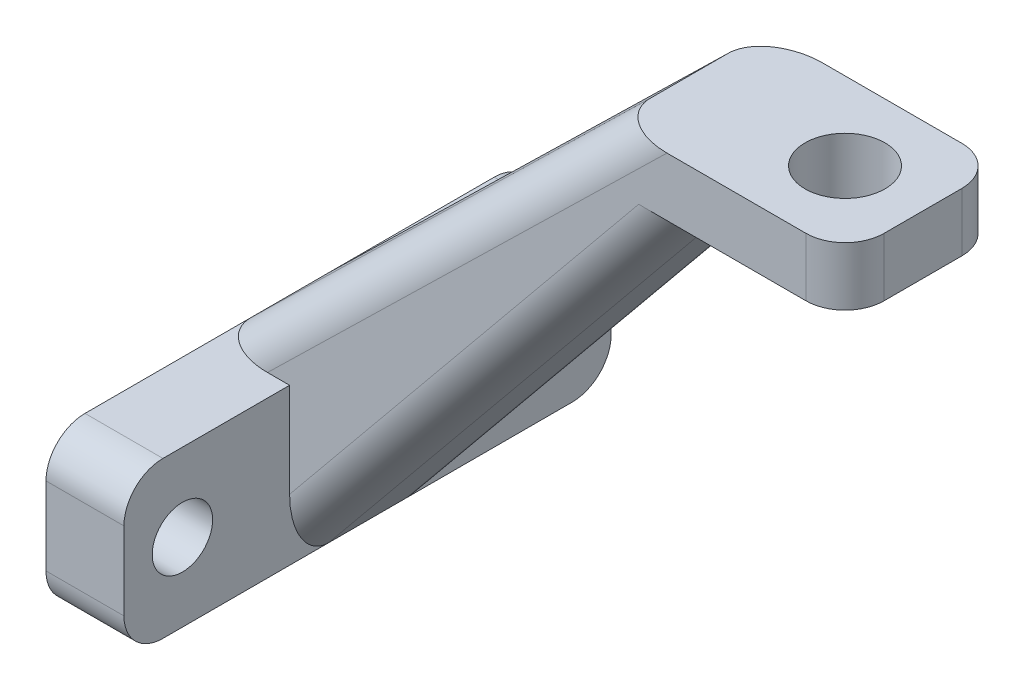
ISO-10303-21;
HEADER;
FILE_DESCRIPTION(('STEP AP214'),'2;1');
FILE_NAME('part.step','',(''),(''),'','','');
FILE_SCHEMA(('AUTOMOTIVE_DESIGN { 1 0 10303 214 1 1 1 1 }'));
ENDSEC;
DATA;
#1=APPLICATION_CONTEXT('core data for automotive mechanical design processes');
#2=APPLICATION_PROTOCOL_DEFINITION('international standard','automotive_design',2000,#1);
#3=PRODUCT_CONTEXT('',#1,'mechanical');
#4=PRODUCT('Part','Part','',(#3));
#5=PRODUCT_RELATED_PRODUCT_CATEGORY('part','',(#4));
#6=PRODUCT_DEFINITION_FORMATION('','',#4);
#7=PRODUCT_DEFINITION_CONTEXT('part definition',#1,'design');
#8=PRODUCT_DEFINITION('design','',#6,#7);
#9=PRODUCT_DEFINITION_SHAPE('','',#8);
#10=(LENGTH_UNIT() NAMED_UNIT(*) SI_UNIT(.MILLI.,.METRE.));
#11=(NAMED_UNIT(*) PLANE_ANGLE_UNIT() SI_UNIT($,.RADIAN.));
#12=(NAMED_UNIT(*) SI_UNIT($,.STERADIAN.) SOLID_ANGLE_UNIT());
#13=UNCERTAINTY_MEASURE_WITH_UNIT(LENGTH_MEASURE(1.E-05),#10,'distance_accuracy_value','');
#14=(GEOMETRIC_REPRESENTATION_CONTEXT(3) GLOBAL_UNCERTAINTY_ASSIGNED_CONTEXT((#13)) GLOBAL_UNIT_ASSIGNED_CONTEXT((#10,
#11,#12)) REPRESENTATION_CONTEXT('',''));
#15=CARTESIAN_POINT('',(0.,0.,0.));
#16=DIRECTION('',(0.,0.,1.));
#17=DIRECTION('',(1.,0.,0.));
#18=AXIS2_PLACEMENT_3D('',#15,#16,#17);
#19=CARTESIAN_POINT('',(-28.5,0.,0.));
#20=DIRECTION('',(1.,0.,0.));
#21=DIRECTION('',(0.,0.,-1.));
#22=AXIS2_PLACEMENT_3D('',#19,#20,#21);
#23=PLANE('',#22);
#24=CARTESIAN_POINT('',(-28.5,-21.,9.5));
#25=DIRECTION('',(1.,0.,0.));
#26=DIRECTION('',(0.,0.,-1.));
#27=AXIS2_PLACEMENT_3D('',#24,#25,#26);
#28=CIRCLE('',#27,1.55);
#29=CARTESIAN_POINT('',(-28.5,-21.,7.95));
#30=VERTEX_POINT('',#29);
#31=EDGE_CURVE('E333',#30,#30,#28,.T.);
#32=ORIENTED_EDGE('',*,*,#31,.T.);
#33=EDGE_LOOP('',(#32));
#34=FACE_BOUND('',#33,.T.);
#35=DIRECTION('',(0.,0.,-1.));
#36=VECTOR('',#35,1.);
#37=CARTESIAN_POINT('',(-28.5,-17.,-12.5));
#38=LINE('',#37,#36);
#39=CARTESIAN_POINT('',(-28.5,-17.,-2.));
#40=VERTEX_POINT('',#39);
#41=CARTESIAN_POINT('',(-28.5,-17.,-10.5));
#42=VERTEX_POINT('',#41);
#43=EDGE_CURVE('E81',#40,#42,#38,.T.);
#44=ORIENTED_EDGE('',*,*,#43,.T.);
#45=CARTESIAN_POINT('',(-28.5,-19.,-10.5));
#46=DIRECTION('',(1.,0.,0.));
#47=DIRECTION('',(0.,0.,-1.));
#48=AXIS2_PLACEMENT_3D('',#45,#46,#47);
#49=CIRCLE('',#48,2.);
#50=CARTESIAN_POINT('',(-28.5,-19.,-12.5));
#51=VERTEX_POINT('',#50);
#52=EDGE_CURVE('E860',#42,#51,#49,.F.);
#53=ORIENTED_EDGE('',*,*,#52,.T.);
#54=DIRECTION('',(0.,-1.,0.));
#55=VECTOR('',#54,1.);
#56=CARTESIAN_POINT('',(-28.5,-25.,-12.5));
#57=LINE('',#56,#55);
#58=CARTESIAN_POINT('',(-28.5,-23.,-12.5));
#59=VERTEX_POINT('',#58);
#60=EDGE_CURVE('E474',#51,#59,#57,.T.);
#61=ORIENTED_EDGE('',*,*,#60,.T.);
#62=CARTESIAN_POINT('',(-28.5,-23.,-10.5));
#63=DIRECTION('',(1.,0.,0.));
#64=DIRECTION('',(0.,0.,-1.));
#65=AXIS2_PLACEMENT_3D('',#62,#63,#64);
#66=CIRCLE('',#65,2.);
#67=CARTESIAN_POINT('',(-28.5,-25.,-10.5));
#68=VERTEX_POINT('',#67);
#69=EDGE_CURVE('E884',#59,#68,#66,.F.);
#70=ORIENTED_EDGE('',*,*,#69,.T.);
#71=DIRECTION('',(0.,0.,1.));
#72=VECTOR('',#71,1.);
#73=CARTESIAN_POINT('',(-28.5,-25.,-12.5));
#74=LINE('',#73,#72);
#75=CARTESIAN_POINT('',(-28.5,-25.,10.5));
#76=VERTEX_POINT('',#75);
#77=EDGE_CURVE('E305',#68,#76,#74,.T.);
#78=ORIENTED_EDGE('',*,*,#77,.T.);
#79=CARTESIAN_POINT('',(-28.5,-23.,10.5));
#80=DIRECTION('',(1.,0.,0.));
#81=DIRECTION('',(0.,0.,-1.));
#82=AXIS2_PLACEMENT_3D('',#79,#80,#81);
#83=CIRCLE('',#82,2.);
#84=CARTESIAN_POINT('',(-28.5,-23.,12.5));
#85=VERTEX_POINT('',#84);
#86=EDGE_CURVE('E484',#76,#85,#83,.F.);
#87=ORIENTED_EDGE('',*,*,#86,.T.);
#88=DIRECTION('',(0.,1.,0.));
#89=VECTOR('',#88,1.);
#90=CARTESIAN_POINT('',(-28.5,-25.,12.5));
#91=LINE('',#90,#89);
#92=CARTESIAN_POINT('',(-28.5,-19.,12.5));
#93=VERTEX_POINT('',#92);
#94=EDGE_CURVE('E297',#85,#93,#91,.T.);
#95=ORIENTED_EDGE('',*,*,#94,.T.);
#96=CARTESIAN_POINT('',(-28.5,-19.,10.5));
#97=DIRECTION('',(1.,0.,0.));
#98=DIRECTION('',(0.,0.,-1.));
#99=AXIS2_PLACEMENT_3D('',#96,#97,#98);
#100=CIRCLE('',#99,2.);
#101=CARTESIAN_POINT('',(-28.5,-17.,10.5));
#102=VERTEX_POINT('',#101);
#103=EDGE_CURVE('E483',#93,#102,#100,.F.);
#104=ORIENTED_EDGE('',*,*,#103,.T.);
#105=CARTESIAN_POINT('',(-28.5,-17.,2.));
#106=VERTEX_POINT('',#105);
#107=EDGE_CURVE('E162',#102,#106,#38,.T.);
#108=ORIENTED_EDGE('',*,*,#107,.T.);
#109=DIRECTION('',(0.,0.,1.));
#110=VECTOR('',#109,1.);
#111=CARTESIAN_POINT('',(-28.5,-17.,-35.6267292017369));
#112=LINE('',#111,#110);
#113=EDGE_CURVE('E319',#40,#106,#112,.T.);
#114=ORIENTED_EDGE('',*,*,#113,.F.);
#115=EDGE_LOOP('',(#44,#53,#61,#70,#78,#87,#95,#104,#108,#114));
#116=FACE_BOUND('',#115,.T.);
#117=CARTESIAN_POINT('',(-28.5,-21.,-9.50000000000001));
#118=DIRECTION('',(1.,0.,0.));
#119=DIRECTION('',(0.,0.,-1.));
#120=AXIS2_PLACEMENT_3D('',#117,#118,#119);
#121=CIRCLE('',#120,1.55);
#122=CARTESIAN_POINT('',(-28.5,-21.,-11.05));
#123=VERTEX_POINT('',#122);
#124=EDGE_CURVE('E341',#123,#123,#121,.F.);
#125=ORIENTED_EDGE('',*,*,#124,.F.);
#126=EDGE_LOOP('',(#125));
#127=FACE_BOUND('',#126,.T.);
#128=ADVANCED_FACE('F47',(#34,#116,#127),#23,.F.);
#129=CARTESIAN_POINT('',(-24.5,-17.,-12.5));
#130=DIRECTION('',(0.,1.,0.));
#131=DIRECTION('',(0.,0.,1.));
#132=AXIS2_PLACEMENT_3D('',#129,#130,#131);
#133=PLANE('',#132);
#134=DIRECTION('',(0.,0.,-1.));
#135=VECTOR('',#134,1.);
#136=CARTESIAN_POINT('',(-24.5,-17.,-12.5));
#137=LINE('',#136,#135);
#138=CARTESIAN_POINT('',(-24.5,-17.,-4.));
#139=VERTEX_POINT('',#138);
#140=CARTESIAN_POINT('',(-24.5,-17.,-10.5));
#141=VERTEX_POINT('',#140);
#142=EDGE_CURVE('E174',#139,#141,#137,.T.);
#143=ORIENTED_EDGE('',*,*,#142,.T.);
#144=DIRECTION('',(-1.,0.,0.));
#145=VECTOR('',#144,1.);
#146=CARTESIAN_POINT('',(-24.5,-17.,-10.5));
#147=LINE('',#146,#145);
#148=EDGE_CURVE('E874',#141,#42,#147,.T.);
#149=ORIENTED_EDGE('',*,*,#148,.T.);
#150=ORIENTED_EDGE('',*,*,#43,.F.);
#151=CARTESIAN_POINT('',(-25.6359993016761,-17.,-2.));
#152=DIRECTION('',(0.,1.,0.));
#153=DIRECTION('',(-1.,0.,0.));
#154=AXIS2_PLACEMENT_3D('',#151,#152,#153);
#155=ELLIPSE('',#154,2.86400069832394,2.);
#156=CARTESIAN_POINT('',(-25.6359993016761,-17.,-4.));
#157=VERTEX_POINT('',#156);
#158=EDGE_CURVE('E165',#40,#157,#155,.F.);
#159=ORIENTED_EDGE('',*,*,#158,.T.);
#160=DIRECTION('',(-1.,0.,0.));
#161=VECTOR('',#160,1.);
#162=CARTESIAN_POINT('',(-28.5,-17.,-4.));
#163=LINE('',#162,#161);
#164=EDGE_CURVE('E328',#139,#157,#163,.T.);
#165=ORIENTED_EDGE('',*,*,#164,.F.);
#166=EDGE_LOOP('',(#143,#149,#150,#159,#165));
#167=FACE_BOUND('',#166,.T.);
#168=ADVANCED_FACE('F241',(#167),#133,.T.);
#169=CARTESIAN_POINT('',(0.,3.,0.));
#170=DIRECTION('',(0.,-1.,0.));
#171=DIRECTION('',(0.,0.,-1.));
#172=AXIS2_PLACEMENT_3D('',#169,#170,#171);
#173=PLANE('',#172);
#174=DIRECTION('',(0.,0.,-1.));
#175=VECTOR('',#174,1.);
#176=CARTESIAN_POINT('',(4.,3.,4.));
#177=LINE('',#176,#175);
#178=CARTESIAN_POINT('',(4.,3.,2.));
#179=VERTEX_POINT('',#178);
#180=CARTESIAN_POINT('',(4.,3.,-2.));
#181=VERTEX_POINT('',#180);
#182=EDGE_CURVE('E386',#179,#181,#177,.T.);
#183=ORIENTED_EDGE('',*,*,#182,.T.);
#184=CARTESIAN_POINT('',(2.,3.,-2.));
#185=DIRECTION('',(0.,-1.,0.));
#186=DIRECTION('',(0.,0.,-1.));
#187=AXIS2_PLACEMENT_3D('',#184,#185,#186);
#188=CIRCLE('',#187,2.);
#189=CARTESIAN_POINT('',(2.,3.,-4.));
#190=VERTEX_POINT('',#189);
#191=EDGE_CURVE('E353',#181,#190,#188,.F.);
#192=ORIENTED_EDGE('',*,*,#191,.T.);
#193=DIRECTION('',(-1.,0.,0.));
#194=VECTOR('',#193,1.);
#195=CARTESIAN_POINT('',(-4.,3.,-4.));
#196=LINE('',#195,#194);
#197=CARTESIAN_POINT('',(-5.13599930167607,3.,-4.));
#198=VERTEX_POINT('',#197);
#199=EDGE_CURVE('E381',#190,#198,#196,.T.);
#200=ORIENTED_EDGE('',*,*,#199,.T.);
#201=CARTESIAN_POINT('',(-5.13599930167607,3.,-2.));
#202=DIRECTION('',(0.,-1.,0.));
#203=DIRECTION('',(-1.,0.,0.));
#204=AXIS2_PLACEMENT_3D('',#201,#202,#203);
#205=ELLIPSE('',#204,2.86400069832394,2.);
#206=CARTESIAN_POINT('',(-8.00000000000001,3.,-2.));
#207=VERTEX_POINT('',#206);
#208=EDGE_CURVE('E834',#198,#207,#205,.F.);
#209=ORIENTED_EDGE('',*,*,#208,.T.);
#210=DIRECTION('',(0.,0.,1.));
#211=VECTOR('',#210,1.);
#212=CARTESIAN_POINT('',(-8.00000000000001,3.,-35.6267292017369));
#213=LINE('',#212,#211);
#214=CARTESIAN_POINT('',(-8.00000000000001,3.,2.));
#215=VERTEX_POINT('',#214);
#216=EDGE_CURVE('E323',#207,#215,#213,.T.);
#217=ORIENTED_EDGE('',*,*,#216,.T.);
#218=CARTESIAN_POINT('',(-5.13599930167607,3.,2.));
#219=DIRECTION('',(0.,-1.,0.));
#220=DIRECTION('',(1.,0.,0.));
#221=AXIS2_PLACEMENT_3D('',#218,#219,#220);
#222=ELLIPSE('',#221,2.86400069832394,2.);
#223=CARTESIAN_POINT('',(-5.13599930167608,3.,4.));
#224=VERTEX_POINT('',#223);
#225=EDGE_CURVE('E830',#215,#224,#222,.F.);
#226=ORIENTED_EDGE('',*,*,#225,.T.);
#227=DIRECTION('',(1.,0.,0.));
#228=VECTOR('',#227,1.);
#229=CARTESIAN_POINT('',(-4.,3.,4.));
#230=LINE('',#229,#228);
#231=CARTESIAN_POINT('',(2.,3.,4.));
#232=VERTEX_POINT('',#231);
#233=EDGE_CURVE('E385',#224,#232,#230,.T.);
#234=ORIENTED_EDGE('',*,*,#233,.T.);
#235=CARTESIAN_POINT('',(2.,3.,2.));
#236=DIRECTION('',(0.,-1.,0.));
#237=DIRECTION('',(0.,0.,-1.));
#238=AXIS2_PLACEMENT_3D('',#235,#236,#237);
#239=CIRCLE('',#238,2.);
#240=EDGE_CURVE('E842',#232,#179,#239,.F.);
#241=ORIENTED_EDGE('',*,*,#240,.T.);
#242=EDGE_LOOP('',(#183,#192,#200,#209,#217,#226,#234,#241));
#243=FACE_BOUND('',#242,.T.);
#244=CARTESIAN_POINT('',(0.,3.,0.));
#245=DIRECTION('',(0.,1.,0.));
#246=DIRECTION('',(0.,0.,1.));
#247=AXIS2_PLACEMENT_3D('',#244,#245,#246);
#248=CIRCLE('',#247,2.05);
#249=CARTESIAN_POINT('',(0.,3.,2.05));
#250=VERTEX_POINT('',#249);
#251=EDGE_CURVE('E457',#250,#250,#248,.T.);
#252=ORIENTED_EDGE('',*,*,#251,.F.);
#253=EDGE_LOOP('',(#252));
#254=FACE_BOUND('',#253,.T.);
#255=ADVANCED_FACE('F427',(#243,#254),#173,.F.);
#256=CARTESIAN_POINT('',(0.,0.,0.));
#257=DIRECTION('',(0.,-1.,0.));
#258=DIRECTION('',(0.,0.,-1.));
#259=AXIS2_PLACEMENT_3D('',#256,#257,#258);
#260=PLANE('',#259);
#261=DIRECTION('',(-1.,0.,0.));
#262=VECTOR('',#261,1.);
#263=CARTESIAN_POINT('',(-4.,0.,-4.));
#264=LINE('',#263,#262);
#265=CARTESIAN_POINT('',(2.,0.,-4.));
#266=VERTEX_POINT('',#265);
#267=CARTESIAN_POINT('',(-6.58642610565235,0.,-4.));
#268=VERTEX_POINT('',#267);
#269=EDGE_CURVE('E364',#266,#268,#264,.T.);
#270=ORIENTED_EDGE('',*,*,#269,.F.);
#271=CARTESIAN_POINT('',(2.,0.,-2.));
#272=DIRECTION('',(0.,-1.,0.));
#273=DIRECTION('',(0.,0.,-1.));
#274=AXIS2_PLACEMENT_3D('',#271,#272,#273);
#275=CIRCLE('',#274,2.);
#276=CARTESIAN_POINT('',(4.,0.,-2.));
#277=VERTEX_POINT('',#276);
#278=EDGE_CURVE('E828',#266,#277,#275,.T.);
#279=ORIENTED_EDGE('',*,*,#278,.T.);
#280=DIRECTION('',(0.,0.,-1.));
#281=VECTOR('',#280,1.);
#282=CARTESIAN_POINT('',(4.,0.,4.));
#283=LINE('',#282,#281);
#284=CARTESIAN_POINT('',(4.,0.,2.));
#285=VERTEX_POINT('',#284);
#286=EDGE_CURVE('E370',#285,#277,#283,.T.);
#287=ORIENTED_EDGE('',*,*,#286,.F.);
#288=CARTESIAN_POINT('',(2.,0.,2.));
#289=DIRECTION('',(0.,-1.,0.));
#290=DIRECTION('',(0.,0.,-1.));
#291=AXIS2_PLACEMENT_3D('',#288,#289,#290);
#292=CIRCLE('',#291,2.);
#293=CARTESIAN_POINT('',(2.,0.,4.));
#294=VERTEX_POINT('',#293);
#295=EDGE_CURVE('E399',#285,#294,#292,.T.);
#296=ORIENTED_EDGE('',*,*,#295,.T.);
#297=DIRECTION('',(1.,0.,0.));
#298=VECTOR('',#297,1.);
#299=CARTESIAN_POINT('',(-4.,0.,4.));
#300=LINE('',#299,#298);
#301=CARTESIAN_POINT('',(-6.58642610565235,0.,4.));
#302=VERTEX_POINT('',#301);
#303=EDGE_CURVE('E93',#302,#294,#300,.T.);
#304=ORIENTED_EDGE('',*,*,#303,.F.);
#305=CARTESIAN_POINT('',(-6.58642610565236,0.,2.));
#306=DIRECTION('',(0.,-1.,0.));
#307=DIRECTION('',(-1.,0.,0.));
#308=AXIS2_PLACEMENT_3D('',#305,#306,#307);
#309=ELLIPSE('',#308,2.58642610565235,2.);
#310=CARTESIAN_POINT('',(-4.,0.,2.));
#311=VERTEX_POINT('',#310);
#312=EDGE_CURVE('E193',#302,#311,#309,.F.);
#313=ORIENTED_EDGE('',*,*,#312,.T.);
#314=CARTESIAN_POINT('',(-4.,0.,-2.));
#315=DIRECTION('',(0.,0.,1.));
#316=VECTOR('',#315,1.);
#317=LINE('',#314,#316);
#318=CARTESIAN_POINT('',(-4.,0.,-2.));
#319=VERTEX_POINT('',#318);
#320=EDGE_CURVE('E369',#319,#311,#317,.T.);
#321=ORIENTED_EDGE('',*,*,#320,.F.);
#322=CARTESIAN_POINT('',(-6.58642610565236,0.,-2.));
#323=DIRECTION('',(0.,-1.,0.));
#324=DIRECTION('',(-1.,0.,0.));
#325=AXIS2_PLACEMENT_3D('',#322,#323,#324);
#326=ELLIPSE('',#325,2.58642610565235,2.);
#327=EDGE_CURVE('E59',#319,#268,#326,.F.);
#328=ORIENTED_EDGE('',*,*,#327,.T.);
#329=EDGE_LOOP('',(#270,#279,#287,#296,#304,#313,#321,#328));
#330=FACE_BOUND('',#329,.T.);
#331=CARTESIAN_POINT('',(0.,0.,0.));
#332=DIRECTION('',(0.,1.,0.));
#333=DIRECTION('',(0.,0.,1.));
#334=AXIS2_PLACEMENT_3D('',#331,#332,#333);
#335=CIRCLE('',#334,2.05);
#336=CARTESIAN_POINT('',(0.,0.,2.05));
#337=VERTEX_POINT('',#336);
#338=EDGE_CURVE('E460',#337,#337,#335,.T.);
#339=ORIENTED_EDGE('',*,*,#338,.T.);
#340=EDGE_LOOP('',(#339));
#341=FACE_BOUND('',#340,.T.);
#342=ADVANCED_FACE('F430',(#330,#341),#260,.T.);
#343=CARTESIAN_POINT('',(4.,3.,4.));
#344=DIRECTION('',(-1.,0.,0.));
#345=DIRECTION('',(0.,0.,1.));
#346=AXIS2_PLACEMENT_3D('',#343,#344,#345);
#347=PLANE('',#346);
#348=ORIENTED_EDGE('',*,*,#286,.T.);
#349=DIRECTION('',(0.,-1.,0.));
#350=VECTOR('',#349,1.);
#351=CARTESIAN_POINT('',(4.,3.,-2.));
#352=LINE('',#351,#350);
#353=EDGE_CURVE('E823',#277,#181,#352,.F.);
#354=ORIENTED_EDGE('',*,*,#353,.T.);
#355=ORIENTED_EDGE('',*,*,#182,.F.);
#356=DIRECTION('',(0.,-1.,0.));
#357=VECTOR('',#356,1.);
#358=CARTESIAN_POINT('',(4.,3.,2.));
#359=LINE('',#358,#357);
#360=EDGE_CURVE('E825',#179,#285,#359,.T.);
#361=ORIENTED_EDGE('',*,*,#360,.T.);
#362=EDGE_LOOP('',(#348,#354,#355,#361));
#363=FACE_BOUND('',#362,.T.);
#364=ADVANCED_FACE('F435',(#363),#347,.F.);
#365=CARTESIAN_POINT('',(-4.,3.,-4.));
#366=DIRECTION('',(0.,0.,1.));
#367=DIRECTION('',(1.,0.,0.));
#368=AXIS2_PLACEMENT_3D('',#365,#366,#367);
#369=PLANE('',#368);
#370=ORIENTED_EDGE('',*,*,#199,.F.);
#371=DIRECTION('',(0.,-1.,0.));
#372=VECTOR('',#371,1.);
#373=CARTESIAN_POINT('',(2.,3.,-4.));
#374=LINE('',#373,#372);
#375=EDGE_CURVE('E395',#190,#266,#374,.T.);
#376=ORIENTED_EDGE('',*,*,#375,.T.);
#377=ORIENTED_EDGE('',*,*,#269,.T.);
#378=DIRECTION('',(0.634079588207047,0.773267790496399,0.));
#379=VECTOR('',#378,1.);
#380=CARTESIAN_POINT('',(-26.0465355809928,-23.7318408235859,-4.));
#381=LINE('',#380,#379);
#382=CARTESIAN_POINT('',(-24.5,-21.8458218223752,-4.));
#383=VERTEX_POINT('',#382);
#384=EDGE_CURVE('E387',#268,#383,#381,.F.);
#385=ORIENTED_EDGE('',*,*,#384,.T.);
#386=DIRECTION('',(0.,1.,0.));
#387=VECTOR('',#386,1.);
#388=CARTESIAN_POINT('',(-24.5,-25.,-4.));
#389=LINE('',#388,#387);
#390=EDGE_CURVE('E371',#383,#139,#389,.T.);
#391=ORIENTED_EDGE('',*,*,#390,.T.);
#392=ORIENTED_EDGE('',*,*,#164,.T.);
#393=DIRECTION('',(0.715781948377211,0.698323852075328,0.));
#394=VECTOR('',#393,1.);
#395=CARTESIAN_POINT('',(-6.60335229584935,1.56843610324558,-4.));
#396=LINE('',#395,#394);
#397=EDGE_CURVE('E391',#157,#198,#396,.T.);
#398=ORIENTED_EDGE('',*,*,#397,.T.);
#399=EDGE_LOOP('',(#370,#376,#377,#385,#391,#392,#398));
#400=FACE_BOUND('',#399,.T.);
#401=ADVANCED_FACE('F573',(#400),#369,.F.);
#402=CARTESIAN_POINT('',(-4.,3.,4.));
#403=DIRECTION('',(0.,0.,-1.));
#404=DIRECTION('',(-1.,0.,0.));
#405=AXIS2_PLACEMENT_3D('',#402,#403,#404);
#406=PLANE('',#405);
#407=ORIENTED_EDGE('',*,*,#303,.T.);
#408=DIRECTION('',(0.,-1.,0.));
#409=VECTOR('',#408,1.);
#410=CARTESIAN_POINT('',(2.,3.,4.));
#411=LINE('',#410,#409);
#412=EDGE_CURVE('E552',#294,#232,#411,.F.);
#413=ORIENTED_EDGE('',*,*,#412,.T.);
#414=ORIENTED_EDGE('',*,*,#233,.F.);
#415=DIRECTION('',(-0.715781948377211,-0.698323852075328,0.));
#416=VECTOR('',#415,1.);
#417=CARTESIAN_POINT('',(-27.1033522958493,-18.4315638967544,4.));
#418=LINE('',#417,#416);
#419=CARTESIAN_POINT('',(-25.6359993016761,-17.,4.));
#420=VERTEX_POINT('',#419);
#421=EDGE_CURVE('E547',#224,#420,#418,.T.);
#422=ORIENTED_EDGE('',*,*,#421,.T.);
#423=DIRECTION('',(1.,0.,0.));
#424=VECTOR('',#423,1.);
#425=CARTESIAN_POINT('',(-28.5,-17.,4.));
#426=LINE('',#425,#424);
#427=CARTESIAN_POINT('',(-24.5,-17.,4.));
#428=VERTEX_POINT('',#427);
#429=EDGE_CURVE('E324',#420,#428,#426,.T.);
#430=ORIENTED_EDGE('',*,*,#429,.T.);
#431=DIRECTION('',(0.,1.,0.));
#432=VECTOR('',#431,1.);
#433=CARTESIAN_POINT('',(-24.5,-25.,4.));
#434=LINE('',#433,#432);
#435=CARTESIAN_POINT('',(-24.5,-21.8458218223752,4.));
#436=VERTEX_POINT('',#435);
#437=EDGE_CURVE('E170',#436,#428,#434,.T.);
#438=ORIENTED_EDGE('',*,*,#437,.F.);
#439=DIRECTION('',(0.634079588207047,0.773267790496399,0.));
#440=VECTOR('',#439,1.);
#441=CARTESIAN_POINT('',(-5.5465355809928,1.26815917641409,4.));
#442=LINE('',#441,#440);
#443=EDGE_CURVE('E553',#436,#302,#442,.T.);
#444=ORIENTED_EDGE('',*,*,#443,.T.);
#445=EDGE_LOOP('',(#407,#413,#414,#422,#430,#438,#444));
#446=FACE_BOUND('',#445,.T.);
#447=ADVANCED_FACE('F425',(#446),#406,.F.);
#448=CARTESIAN_POINT('',(0.,3.,0.));
#449=DIRECTION('',(0.,-1.,0.));
#450=DIRECTION('',(0.,0.,-1.));
#451=AXIS2_PLACEMENT_3D('',#448,#449,#450);
#452=CYLINDRICAL_SURFACE('',#451,2.05);
#453=ORIENTED_EDGE('',*,*,#251,.T.);
#454=EDGE_LOOP('',(#453));
#455=FACE_BOUND('',#454,.T.);
#456=ORIENTED_EDGE('',*,*,#338,.F.);
#457=EDGE_LOOP('',(#456));
#458=FACE_BOUND('',#457,.T.);
#459=ADVANCED_FACE('F421',(#455,#458),#452,.F.);
#460=CARTESIAN_POINT('',(-2.39177230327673,1.96125328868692,0.));
#461=DIRECTION('',(0.773267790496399,-0.634079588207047,0.));
#462=DIRECTION('',(0.634079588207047,0.773267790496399,0.));
#463=AXIS2_PLACEMENT_3D('',#460,#461,#462);
#464=PLANE('',#463);
#465=ORIENTED_EDGE('',*,*,#320,.T.);
#466=DIRECTION('',(0.634079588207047,0.773267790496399,0.));
#467=VECTOR('',#466,1.);
#468=CARTESIAN_POINT('',(-24.5,-25.,2.));
#469=LINE('',#468,#467);
#470=CARTESIAN_POINT('',(-24.5,-25.,2.));
#471=VERTEX_POINT('',#470);
#472=EDGE_CURVE('E279',#311,#471,#469,.F.);
#473=ORIENTED_EDGE('',*,*,#472,.T.);
#474=DIRECTION('',(0.,0.,-1.));
#475=VECTOR('',#474,1.);
#476=CARTESIAN_POINT('',(-24.5,-25.,4.));
#477=LINE('',#476,#475);
#478=CARTESIAN_POINT('',(-24.5,-25.,-2.));
#479=VERTEX_POINT('',#478);
#480=EDGE_CURVE('E51',#471,#479,#477,.T.);
#481=ORIENTED_EDGE('',*,*,#480,.T.);
#482=DIRECTION('',(0.634079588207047,0.773267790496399,0.));
#483=VECTOR('',#482,1.);
#484=CARTESIAN_POINT('',(-4.00000000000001,0.,-2.));
#485=LINE('',#484,#483);
#486=EDGE_CURVE('E275',#479,#319,#485,.T.);
#487=ORIENTED_EDGE('',*,*,#486,.T.);
#488=EDGE_LOOP('',(#465,#473,#481,#487));
#489=FACE_BOUND('',#488,.T.);
#490=ADVANCED_FACE('F411',(#489),#464,.T.);
#491=CARTESIAN_POINT('',(-24.5,0.,0.));
#492=DIRECTION('',(1.,0.,0.));
#493=DIRECTION('',(0.,0.,-1.));
#494=AXIS2_PLACEMENT_3D('',#491,#492,#493);
#495=PLANE('',#494);
#496=CARTESIAN_POINT('',(-24.5,-21.,9.5));
#497=DIRECTION('',(1.,0.,0.));
#498=DIRECTION('',(0.,0.,-1.));
#499=AXIS2_PLACEMENT_3D('',#496,#497,#498);
#500=CIRCLE('',#499,1.55);
#501=CARTESIAN_POINT('',(-24.5,-21.,7.95));
#502=VERTEX_POINT('',#501);
#503=EDGE_CURVE('E329',#502,#502,#500,.T.);
#504=ORIENTED_EDGE('',*,*,#503,.F.);
#505=EDGE_LOOP('',(#504));
#506=FACE_BOUND('',#505,.T.);
#507=DIRECTION('',(0.,1.,0.));
#508=VECTOR('',#507,1.);
#509=CARTESIAN_POINT('',(-24.5,-25.,12.5));
#510=LINE('',#509,#508);
#511=CARTESIAN_POINT('',(-24.5,-23.,12.5));
#512=VERTEX_POINT('',#511);
#513=CARTESIAN_POINT('',(-24.5,-19.,12.5));
#514=VERTEX_POINT('',#513);
#515=EDGE_CURVE('E309',#512,#514,#510,.T.);
#516=ORIENTED_EDGE('',*,*,#515,.F.);
#517=CARTESIAN_POINT('',(-24.5,-23.,10.5));
#518=DIRECTION('',(1.,0.,0.));
#519=DIRECTION('',(0.,0.,-1.));
#520=AXIS2_PLACEMENT_3D('',#517,#518,#519);
#521=CIRCLE('',#520,2.);
#522=CARTESIAN_POINT('',(-24.5,-25.,10.5));
#523=VERTEX_POINT('',#522);
#524=EDGE_CURVE('E166',#512,#523,#521,.T.);
#525=ORIENTED_EDGE('',*,*,#524,.T.);
#526=DIRECTION('',(0.,0.,1.));
#527=VECTOR('',#526,1.);
#528=CARTESIAN_POINT('',(-24.5,-25.,-12.5));
#529=LINE('',#528,#527);
#530=CARTESIAN_POINT('',(-24.5,-25.,4.));
#531=VERTEX_POINT('',#530);
#532=EDGE_CURVE('E292',#531,#523,#529,.T.);
#533=ORIENTED_EDGE('',*,*,#532,.F.);
#534=CARTESIAN_POINT('',(-24.5,-25.,4.));
#535=DIRECTION('',(0.,0.,-1.));
#536=VECTOR('',#535,1.);
#537=LINE('',#534,#536);
#538=EDGE_CURVE('E213',#531,#471,#537,.T.);
#539=ORIENTED_EDGE('',*,*,#538,.T.);
#540=CARTESIAN_POINT('',(-24.5,-21.8458218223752,2.));
#541=DIRECTION('',(1.,0.,0.));
#542=DIRECTION('',(0.,-1.,0.));
#543=AXIS2_PLACEMENT_3D('',#540,#541,#542);
#544=ELLIPSE('',#543,3.15417817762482,2.);
#545=EDGE_CURVE('E196',#471,#436,#544,.F.);
#546=ORIENTED_EDGE('',*,*,#545,.T.);
#547=ORIENTED_EDGE('',*,*,#437,.T.);
#548=CARTESIAN_POINT('',(-24.5,-17.,10.5));
#549=VERTEX_POINT('',#548);
#550=EDGE_CURVE('E159',#549,#428,#137,.T.);
#551=ORIENTED_EDGE('',*,*,#550,.F.);
#552=CARTESIAN_POINT('',(-24.5,-19.,10.5));
#553=DIRECTION('',(1.,0.,0.));
#554=DIRECTION('',(0.,0.,-1.));
#555=AXIS2_PLACEMENT_3D('',#552,#553,#554);
#556=CIRCLE('',#555,2.);
#557=EDGE_CURVE('E148',#549,#514,#556,.T.);
#558=ORIENTED_EDGE('',*,*,#557,.T.);
#559=EDGE_LOOP('',(#516,#525,#533,#539,#546,#547,#551,#558));
#560=FACE_BOUND('',#559,.T.);
#561=ADVANCED_FACE('F168',(#506,#560),#495,.T.);
#562=CARTESIAN_POINT('',(-24.5,-25.,12.5));
#563=DIRECTION('',(0.,0.,1.));
#564=DIRECTION('',(1.,0.,0.));
#565=AXIS2_PLACEMENT_3D('',#562,#563,#564);
#566=PLANE('',#565);
#567=ORIENTED_EDGE('',*,*,#94,.F.);
#568=DIRECTION('',(-1.,0.,0.));
#569=VECTOR('',#568,1.);
#570=CARTESIAN_POINT('',(-24.5,-23.,12.5));
#571=LINE('',#570,#569);
#572=EDGE_CURVE('E180',#85,#512,#571,.F.);
#573=ORIENTED_EDGE('',*,*,#572,.T.);
#574=ORIENTED_EDGE('',*,*,#515,.T.);
#575=DIRECTION('',(-1.,0.,0.));
#576=VECTOR('',#575,1.);
#577=CARTESIAN_POINT('',(-24.5,-19.,12.5));
#578=LINE('',#577,#576);
#579=EDGE_CURVE('E178',#514,#93,#578,.T.);
#580=ORIENTED_EDGE('',*,*,#579,.T.);
#581=EDGE_LOOP('',(#567,#573,#574,#580));
#582=FACE_BOUND('',#581,.T.);
#583=ADVANCED_FACE('F248',(#582),#566,.T.);
#584=CARTESIAN_POINT('',(-24.5,-25.,-12.5));
#585=DIRECTION('',(0.,-1.,0.));
#586=DIRECTION('',(0.,0.,-1.));
#587=AXIS2_PLACEMENT_3D('',#584,#585,#586);
#588=PLANE('',#587);
#589=ORIENTED_EDGE('',*,*,#77,.F.);
#590=DIRECTION('',(-1.,0.,0.));
#591=VECTOR('',#590,1.);
#592=CARTESIAN_POINT('',(-24.5,-25.,-10.5));
#593=LINE('',#592,#591);
#594=CARTESIAN_POINT('',(-24.5,-25.,-10.5));
#595=VERTEX_POINT('',#594);
#596=EDGE_CURVE('E876',#68,#595,#593,.F.);
#597=ORIENTED_EDGE('',*,*,#596,.T.);
#598=CARTESIAN_POINT('',(-24.5,-25.,-4.));
#599=VERTEX_POINT('',#598);
#600=EDGE_CURVE('E288',#595,#599,#529,.T.);
#601=ORIENTED_EDGE('',*,*,#600,.T.);
#602=CARTESIAN_POINT('',(-24.5,-25.,-2.));
#603=DIRECTION('',(0.,0.,-1.));
#604=VECTOR('',#603,1.);
#605=LINE('',#602,#604);
#606=EDGE_CURVE('E66',#479,#599,#605,.T.);
#607=ORIENTED_EDGE('',*,*,#606,.F.);
#608=ORIENTED_EDGE('',*,*,#480,.F.);
#609=ORIENTED_EDGE('',*,*,#538,.F.);
#610=ORIENTED_EDGE('',*,*,#532,.T.);
#611=DIRECTION('',(-1.,0.,0.));
#612=VECTOR('',#611,1.);
#613=CARTESIAN_POINT('',(-24.5,-25.,10.5));
#614=LINE('',#613,#612);
#615=EDGE_CURVE('E285',#523,#76,#614,.T.);
#616=ORIENTED_EDGE('',*,*,#615,.T.);
#617=EDGE_LOOP('',(#589,#597,#601,#607,#608,#609,#610,#616));
#618=FACE_BOUND('',#617,.T.);
#619=ADVANCED_FACE('F243',(#618),#588,.T.);
#620=CARTESIAN_POINT('',(-24.5,-25.,-12.5));
#621=DIRECTION('',(0.,0.,-1.));
#622=DIRECTION('',(-1.,0.,0.));
#623=AXIS2_PLACEMENT_3D('',#620,#621,#622);
#624=PLANE('',#623);
#625=ORIENTED_EDGE('',*,*,#60,.F.);
#626=DIRECTION('',(-1.,0.,0.));
#627=VECTOR('',#626,1.);
#628=CARTESIAN_POINT('',(-24.5,-19.,-12.5));
#629=LINE('',#628,#627);
#630=CARTESIAN_POINT('',(-24.5,-19.,-12.5));
#631=VERTEX_POINT('',#630);
#632=EDGE_CURVE('E855',#51,#631,#629,.F.);
#633=ORIENTED_EDGE('',*,*,#632,.T.);
#634=DIRECTION('',(0.,-1.,0.));
#635=VECTOR('',#634,1.);
#636=CARTESIAN_POINT('',(-24.5,-25.,-12.5));
#637=LINE('',#636,#635);
#638=CARTESIAN_POINT('',(-24.5,-23.,-12.5));
#639=VERTEX_POINT('',#638);
#640=EDGE_CURVE('E173',#631,#639,#637,.T.);
#641=ORIENTED_EDGE('',*,*,#640,.T.);
#642=DIRECTION('',(-1.,0.,0.));
#643=VECTOR('',#642,1.);
#644=CARTESIAN_POINT('',(-24.5,-23.,-12.5));
#645=LINE('',#644,#643);
#646=EDGE_CURVE('E857',#639,#59,#645,.T.);
#647=ORIENTED_EDGE('',*,*,#646,.T.);
#648=EDGE_LOOP('',(#625,#633,#641,#647));
#649=FACE_BOUND('',#648,.T.);
#650=ADVANCED_FACE('F247',(#649),#624,.T.);
#651=ORIENTED_EDGE('',*,*,#107,.F.);
#652=DIRECTION('',(-1.,0.,0.));
#653=VECTOR('',#652,1.);
#654=CARTESIAN_POINT('',(-24.5,-17.,10.5));
#655=LINE('',#654,#653);
#656=EDGE_CURVE('E155',#102,#549,#655,.F.);
#657=ORIENTED_EDGE('',*,*,#656,.T.);
#658=ORIENTED_EDGE('',*,*,#550,.T.);
#659=ORIENTED_EDGE('',*,*,#429,.F.);
#660=CARTESIAN_POINT('',(-25.6359993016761,-17.,2.));
#661=DIRECTION('',(0.,1.,0.));
#662=DIRECTION('',(1.,0.,0.));
#663=AXIS2_PLACEMENT_3D('',#660,#661,#662);
#664=ELLIPSE('',#663,2.86400069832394,2.);
#665=EDGE_CURVE('E190',#420,#106,#664,.F.);
#666=ORIENTED_EDGE('',*,*,#665,.T.);
#667=EDGE_LOOP('',(#651,#657,#658,#659,#666));
#668=FACE_BOUND('',#667,.T.);
#669=ADVANCED_FACE('F156',(#668),#133,.T.);
#670=CARTESIAN_POINT('',(-24.5,-21.,-9.50000000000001));
#671=DIRECTION('',(1.,0.,0.));
#672=DIRECTION('',(0.,0.,-1.));
#673=AXIS2_PLACEMENT_3D('',#670,#671,#672);
#674=CIRCLE('',#673,1.55);
#675=CARTESIAN_POINT('',(-24.5,-21.,-11.05));
#676=VERTEX_POINT('',#675);
#677=EDGE_CURVE('E337',#676,#676,#674,.F.);
#678=ORIENTED_EDGE('',*,*,#677,.T.);
#679=EDGE_LOOP('',(#678));
#680=FACE_BOUND('',#679,.T.);
#681=ORIENTED_EDGE('',*,*,#640,.F.);
#682=CARTESIAN_POINT('',(-24.5,-19.,-10.5));
#683=DIRECTION('',(1.,0.,0.));
#684=DIRECTION('',(0.,0.,-1.));
#685=AXIS2_PLACEMENT_3D('',#682,#683,#684);
#686=CIRCLE('',#685,2.);
#687=EDGE_CURVE('E861',#631,#141,#686,.T.);
#688=ORIENTED_EDGE('',*,*,#687,.T.);
#689=ORIENTED_EDGE('',*,*,#142,.F.);
#690=ORIENTED_EDGE('',*,*,#390,.F.);
#691=CARTESIAN_POINT('',(-24.5,-21.8458218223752,-2.));
#692=DIRECTION('',(1.,0.,0.));
#693=DIRECTION('',(0.,-1.,0.));
#694=AXIS2_PLACEMENT_3D('',#691,#692,#693);
#695=ELLIPSE('',#694,3.15417817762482,2.);
#696=EDGE_CURVE('E12',#383,#479,#695,.F.);
#697=ORIENTED_EDGE('',*,*,#696,.T.);
#698=ORIENTED_EDGE('',*,*,#606,.T.);
#699=ORIENTED_EDGE('',*,*,#600,.F.);
#700=CARTESIAN_POINT('',(-24.5,-23.,-10.5));
#701=DIRECTION('',(1.,0.,0.));
#702=DIRECTION('',(0.,0.,-1.));
#703=AXIS2_PLACEMENT_3D('',#700,#701,#702);
#704=CIRCLE('',#703,2.);
#705=EDGE_CURVE('E863',#595,#639,#704,.T.);
#706=ORIENTED_EDGE('',*,*,#705,.T.);
#707=EDGE_LOOP('',(#681,#688,#689,#690,#697,#698,#699,#706));
#708=FACE_BOUND('',#707,.T.);
#709=ADVANCED_FACE('F218',(#680,#708),#495,.T.);
#710=CARTESIAN_POINT('',(-8.00000000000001,3.,-35.6267292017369));
#711=DIRECTION('',(-0.698323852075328,0.715781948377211,0.));
#712=DIRECTION('',(-0.715781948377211,-0.698323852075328,0.));
#713=AXIS2_PLACEMENT_3D('',#710,#711,#712);
#714=PLANE('',#713);
#715=ORIENTED_EDGE('',*,*,#216,.F.);
#716=DIRECTION('',(0.715781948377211,0.698323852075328,0.));
#717=VECTOR('',#716,1.);
#718=CARTESIAN_POINT('',(-28.5,-17.,-2.));
#719=LINE('',#718,#717);
#720=EDGE_CURVE('E280',#207,#40,#719,.F.);
#721=ORIENTED_EDGE('',*,*,#720,.T.);
#722=ORIENTED_EDGE('',*,*,#113,.T.);
#723=DIRECTION('',(-0.715781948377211,-0.698323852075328,0.));
#724=VECTOR('',#723,1.);
#725=CARTESIAN_POINT('',(-8.00000000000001,3.,2.));
#726=LINE('',#725,#724);
#727=EDGE_CURVE('E548',#106,#215,#726,.F.);
#728=ORIENTED_EDGE('',*,*,#727,.T.);
#729=EDGE_LOOP('',(#715,#721,#722,#728));
#730=FACE_BOUND('',#729,.T.);
#731=ADVANCED_FACE('F228',(#730),#714,.T.);
#732=CARTESIAN_POINT('',(-28.5,-21.,9.5));
#733=DIRECTION('',(1.,0.,0.));
#734=DIRECTION('',(0.,0.,-1.));
#735=AXIS2_PLACEMENT_3D('',#732,#733,#734);
#736=CYLINDRICAL_SURFACE('',#735,1.55);
#737=ORIENTED_EDGE('',*,*,#31,.F.);
#738=EDGE_LOOP('',(#737));
#739=FACE_BOUND('',#738,.T.);
#740=ORIENTED_EDGE('',*,*,#503,.T.);
#741=EDGE_LOOP('',(#740));
#742=FACE_BOUND('',#741,.T.);
#743=ADVANCED_FACE('F680',(#739,#742),#736,.F.);
#744=CARTESIAN_POINT('',(-28.5,-21.,-9.50000000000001));
#745=DIRECTION('',(1.,0.,0.));
#746=DIRECTION('',(0.,0.,-1.));
#747=AXIS2_PLACEMENT_3D('',#744,#745,#746);
#748=CYLINDRICAL_SURFACE('',#747,1.55);
#749=ORIENTED_EDGE('',*,*,#124,.T.);
#750=EDGE_LOOP('',(#749));
#751=FACE_BOUND('',#750,.T.);
#752=ORIENTED_EDGE('',*,*,#677,.F.);
#753=EDGE_LOOP('',(#752));
#754=FACE_BOUND('',#753,.T.);
#755=ADVANCED_FACE('F668',(#751,#754),#748,.F.);
#756=CARTESIAN_POINT('',(2.,3.,-2.));
#757=DIRECTION('',(0.,-1.,0.));
#758=DIRECTION('',(0.,0.,-1.));
#759=AXIS2_PLACEMENT_3D('',#756,#757,#758);
#760=CYLINDRICAL_SURFACE('',#759,2.);
#761=ORIENTED_EDGE('',*,*,#191,.F.);
#762=ORIENTED_EDGE('',*,*,#353,.F.);
#763=ORIENTED_EDGE('',*,*,#278,.F.);
#764=ORIENTED_EDGE('',*,*,#375,.F.);
#765=EDGE_LOOP('',(#761,#762,#763,#764));
#766=FACE_BOUND('',#765,.T.);
#767=ADVANCED_FACE('F658',(#766),#760,.T.);
#768=CARTESIAN_POINT('',(2.,3.,2.));
#769=DIRECTION('',(0.,-1.,0.));
#770=DIRECTION('',(0.,0.,-1.));
#771=AXIS2_PLACEMENT_3D('',#768,#769,#770);
#772=CYLINDRICAL_SURFACE('',#771,2.);
#773=ORIENTED_EDGE('',*,*,#240,.F.);
#774=ORIENTED_EDGE('',*,*,#412,.F.);
#775=ORIENTED_EDGE('',*,*,#295,.F.);
#776=ORIENTED_EDGE('',*,*,#360,.F.);
#777=EDGE_LOOP('',(#773,#774,#775,#776));
#778=FACE_BOUND('',#777,.T.);
#779=ADVANCED_FACE('F650',(#778),#772,.T.);
#780=CARTESIAN_POINT('',(-4.55397710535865,3.56782653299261,-2.));
#781=DIRECTION('',(-0.715781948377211,-0.698323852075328,0.));
#782=DIRECTION('',(0.698323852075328,-0.715781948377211,0.));
#783=AXIS2_PLACEMENT_3D('',#780,#781,#782);
#784=CYLINDRICAL_SURFACE('',#783,2.);
#785=ORIENTED_EDGE('',*,*,#158,.F.);
#786=ORIENTED_EDGE('',*,*,#720,.F.);
#787=ORIENTED_EDGE('',*,*,#208,.F.);
#788=ORIENTED_EDGE('',*,*,#397,.F.);
#789=EDGE_LOOP('',(#785,#786,#787,#788));
#790=FACE_BOUND('',#789,.T.);
#791=ADVANCED_FACE('F568',(#790),#784,.T.);
#792=CARTESIAN_POINT('',(-4.55397710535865,3.56782653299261,2.));
#793=DIRECTION('',(0.715781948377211,0.698323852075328,0.));
#794=DIRECTION('',(-0.698323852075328,0.715781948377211,0.));
#795=AXIS2_PLACEMENT_3D('',#792,#793,#794);
#796=CYLINDRICAL_SURFACE('',#795,2.);
#797=ORIENTED_EDGE('',*,*,#225,.F.);
#798=ORIENTED_EDGE('',*,*,#727,.F.);
#799=ORIENTED_EDGE('',*,*,#665,.F.);
#800=ORIENTED_EDGE('',*,*,#421,.F.);
#801=EDGE_LOOP('',(#797,#798,#799,#800));
#802=FACE_BOUND('',#801,.T.);
#803=ADVANCED_FACE('F546',(#802),#796,.T.);
#804=CARTESIAN_POINT('',(-4.07559561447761,3.06198840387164,2.));
#805=DIRECTION('',(-0.634079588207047,-0.773267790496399,0.));
#806=DIRECTION('',(0.773267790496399,-0.634079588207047,0.));
#807=AXIS2_PLACEMENT_3D('',#804,#805,#806);
#808=CYLINDRICAL_SURFACE('',#807,2.);
#809=ORIENTED_EDGE('',*,*,#545,.F.);
#810=ORIENTED_EDGE('',*,*,#472,.F.);
#811=ORIENTED_EDGE('',*,*,#312,.F.);
#812=ORIENTED_EDGE('',*,*,#443,.F.);
#813=EDGE_LOOP('',(#809,#810,#811,#812));
#814=FACE_BOUND('',#813,.T.);
#815=ADVANCED_FACE('F585',(#814),#808,.T.);
#816=CARTESIAN_POINT('',(-3.93830788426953,3.22941246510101,-2.));
#817=DIRECTION('',(-0.634079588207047,-0.773267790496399,0.));
#818=DIRECTION('',(0.773267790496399,-0.634079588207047,0.));
#819=AXIS2_PLACEMENT_3D('',#816,#817,#818);
#820=CYLINDRICAL_SURFACE('',#819,2.);
#821=ORIENTED_EDGE('',*,*,#696,.F.);
#822=ORIENTED_EDGE('',*,*,#384,.F.);
#823=ORIENTED_EDGE('',*,*,#327,.F.);
#824=ORIENTED_EDGE('',*,*,#486,.F.);
#825=EDGE_LOOP('',(#821,#822,#823,#824));
#826=FACE_BOUND('',#825,.T.);
#827=ADVANCED_FACE('F580',(#826),#820,.T.);
#828=CARTESIAN_POINT('',(-24.5,-19.,-10.5));
#829=DIRECTION('',(-1.,0.,0.));
#830=DIRECTION('',(0.,0.,1.));
#831=AXIS2_PLACEMENT_3D('',#828,#829,#830);
#832=CYLINDRICAL_SURFACE('',#831,2.);
#833=ORIENTED_EDGE('',*,*,#687,.F.);
#834=ORIENTED_EDGE('',*,*,#632,.F.);
#835=ORIENTED_EDGE('',*,*,#52,.F.);
#836=ORIENTED_EDGE('',*,*,#148,.F.);
#837=EDGE_LOOP('',(#833,#834,#835,#836));
#838=FACE_BOUND('',#837,.T.);
#839=ADVANCED_FACE('F592',(#838),#832,.T.);
#840=CARTESIAN_POINT('',(-24.5,-23.,-10.5));
#841=DIRECTION('',(-1.,0.,0.));
#842=DIRECTION('',(0.,0.,1.));
#843=AXIS2_PLACEMENT_3D('',#840,#841,#842);
#844=CYLINDRICAL_SURFACE('',#843,2.);
#845=ORIENTED_EDGE('',*,*,#705,.F.);
#846=ORIENTED_EDGE('',*,*,#596,.F.);
#847=ORIENTED_EDGE('',*,*,#69,.F.);
#848=ORIENTED_EDGE('',*,*,#646,.F.);
#849=EDGE_LOOP('',(#845,#846,#847,#848));
#850=FACE_BOUND('',#849,.T.);
#851=ADVANCED_FACE('F599',(#850),#844,.T.);
#852=CARTESIAN_POINT('',(-24.5,-23.,10.5));
#853=DIRECTION('',(-1.,0.,0.));
#854=DIRECTION('',(0.,0.,1.));
#855=AXIS2_PLACEMENT_3D('',#852,#853,#854);
#856=CYLINDRICAL_SURFACE('',#855,2.);
#857=ORIENTED_EDGE('',*,*,#524,.F.);
#858=ORIENTED_EDGE('',*,*,#572,.F.);
#859=ORIENTED_EDGE('',*,*,#86,.F.);
#860=ORIENTED_EDGE('',*,*,#615,.F.);
#861=EDGE_LOOP('',(#857,#858,#859,#860));
#862=FACE_BOUND('',#861,.T.);
#863=ADVANCED_FACE('F489',(#862),#856,.T.);
#864=CARTESIAN_POINT('',(-24.5,-19.,10.5));
#865=DIRECTION('',(-1.,0.,0.));
#866=DIRECTION('',(0.,0.,1.));
#867=AXIS2_PLACEMENT_3D('',#864,#865,#866);
#868=CYLINDRICAL_SURFACE('',#867,2.);
#869=ORIENTED_EDGE('',*,*,#557,.F.);
#870=ORIENTED_EDGE('',*,*,#656,.F.);
#871=ORIENTED_EDGE('',*,*,#103,.F.);
#872=ORIENTED_EDGE('',*,*,#579,.F.);
#873=EDGE_LOOP('',(#869,#870,#871,#872));
#874=FACE_BOUND('',#873,.T.);
#875=ADVANCED_FACE('F49',(#874),#868,.T.);
#876=CLOSED_SHELL('',(#128,#168,#255,#342,#364,#401,#447,#459,#490,#561,#583,#619,#650,#669,
#709,#731,#743,#755,#767,#779,#791,#803,#815,#827,#839,#851,#863,#875));
#877=MANIFOLD_SOLID_BREP('B2',#876);
#878=ADVANCED_BREP_SHAPE_REPRESENTATION('',(#18,#877),#14);
#879=SHAPE_DEFINITION_REPRESENTATION(#9,#878);
ENDSEC;
END-ISO-10303-21;
